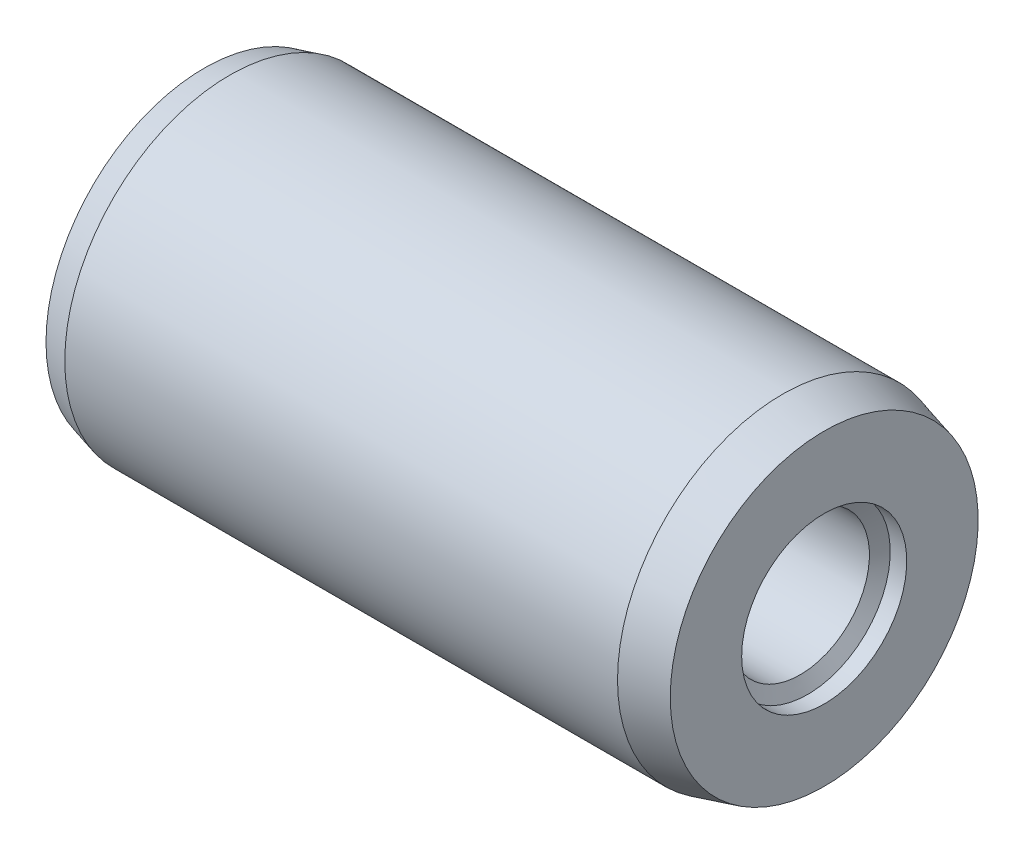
from build123d import *


with BuildPart() as part:
    # Sketch1 → Base-Revolve (revolve)
    with BuildSketch(Plane.XY, mode=Mode.PRIVATE) as base_revolve_sk:
        Polygon((0, 0), (0, 22.320508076), (10, 25), (93.7, 25), (100, 23.311920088), (100, 12.5), (97.5, 12.5), (96.345299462, 10.5), (50, 10.5), (43.6909635, 0), align=None)
    revolve(base_revolve_sk.sketch.rotate(Axis((-10, 0, 0), (1, 0, 0)), 90), axis=Axis((-10, 0, 0), (1, 0, 0)))

    # Sketch2 → TypeA (revolve, cut)
    with BuildSketch(Plane.XY, mode=Mode.PRIVATE) as typea_sk:
        with BuildLine():
            Line((6.114035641, 23.958758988), (6.114035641, 30))
            Line((6.114035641, 30), (-5, 30))
            Line((-5, 30), (-5, 0))
            Line((-5, 0), (0, 0))
            ThreePointArc((0, 0), (1.552615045, 12.363288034), (6.114035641, 23.958758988))
        make_face()
    revolve(typea_sk.sketch.rotate(Axis((0, 0, 0), (1, 0, 0)), 180), axis=Axis((0, 0, 0), (1, 0, 0)), mode=Mode.SUBTRACT)


solid = part.part
